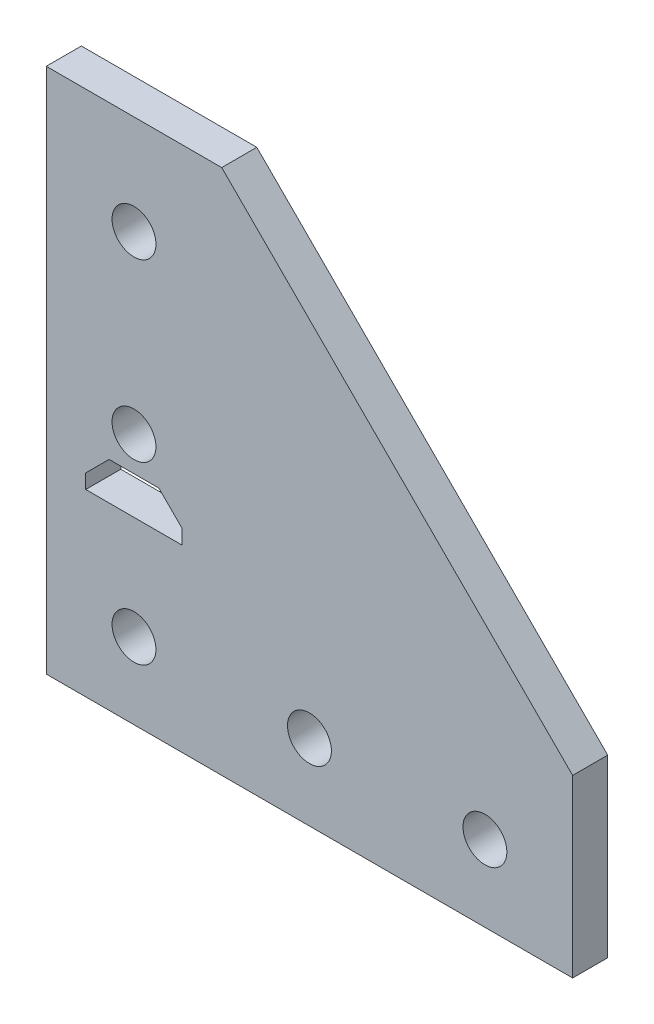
ISO-10303-21;
HEADER;
FILE_DESCRIPTION(('STEP AP214'),'2;1');
FILE_NAME('part.step','',(''),(''),'','','');
FILE_SCHEMA(('AUTOMOTIVE_DESIGN { 1 0 10303 214 1 1 1 1 }'));
ENDSEC;
DATA;
#1=APPLICATION_CONTEXT('core data for automotive mechanical design processes');
#2=APPLICATION_PROTOCOL_DEFINITION('international standard','automotive_design',2000,#1);
#3=PRODUCT_CONTEXT('',#1,'mechanical');
#4=PRODUCT('Part','Part','',(#3));
#5=PRODUCT_RELATED_PRODUCT_CATEGORY('part','',(#4));
#6=PRODUCT_DEFINITION_FORMATION('','',#4);
#7=PRODUCT_DEFINITION_CONTEXT('part definition',#1,'design');
#8=PRODUCT_DEFINITION('design','',#6,#7);
#9=PRODUCT_DEFINITION_SHAPE('','',#8);
#10=(LENGTH_UNIT() NAMED_UNIT(*) SI_UNIT(.MILLI.,.METRE.));
#11=(NAMED_UNIT(*) PLANE_ANGLE_UNIT() SI_UNIT($,.RADIAN.));
#12=(NAMED_UNIT(*) SI_UNIT($,.STERADIAN.) SOLID_ANGLE_UNIT());
#13=UNCERTAINTY_MEASURE_WITH_UNIT(LENGTH_MEASURE(1.E-05),#10,'distance_accuracy_value','');
#14=(GEOMETRIC_REPRESENTATION_CONTEXT(3) GLOBAL_UNCERTAINTY_ASSIGNED_CONTEXT((#13)) GLOBAL_UNIT_ASSIGNED_CONTEXT((#10,
#11,#12)) REPRESENTATION_CONTEXT('',''));
#15=CARTESIAN_POINT('',(0.,0.,0.));
#16=DIRECTION('',(0.,0.,1.));
#17=DIRECTION('',(1.,0.,0.));
#18=AXIS2_PLACEMENT_3D('',#15,#16,#17);
#19=CARTESIAN_POINT('',(10.,28.6725347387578,84.9470423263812));
#20=DIRECTION('',(0.,0.,1.));
#21=DIRECTION('',(1.,0.,0.));
#22=AXIS2_PLACEMENT_3D('',#19,#20,#21);
#23=CYLINDRICAL_SURFACE('',#22,2.5);
#24=CARTESIAN_POINT('',(10.,28.6725347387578,4.));
#25=DIRECTION('',(0.,0.,-1.));
#26=DIRECTION('',(1.,0.,0.));
#27=AXIS2_PLACEMENT_3D('',#24,#25,#26);
#28=CIRCLE('',#27,2.5);
#29=CARTESIAN_POINT('',(7.5,28.6725347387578,4.));
#30=VERTEX_POINT('',#29);
#31=EDGE_CURVE('E205',#30,#30,#28,.T.);
#32=ORIENTED_EDGE('',*,*,#31,.F.);
#33=EDGE_LOOP('',(#32));
#34=FACE_BOUND('',#33,.T.);
#35=CARTESIAN_POINT('',(10.,28.6725347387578,0.));
#36=DIRECTION('',(0.,0.,1.));
#37=DIRECTION('',(1.,0.,0.));
#38=AXIS2_PLACEMENT_3D('',#35,#36,#37);
#39=CIRCLE('',#38,2.5);
#40=CARTESIAN_POINT('',(12.5,28.6725347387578,0.));
#41=VERTEX_POINT('',#40);
#42=EDGE_CURVE('E210',#41,#41,#39,.T.);
#43=ORIENTED_EDGE('',*,*,#42,.F.);
#44=EDGE_LOOP('',(#43));
#45=FACE_BOUND('',#44,.T.);
#46=ADVANCED_FACE('F37',(#34,#45),#23,.F.);
#47=CARTESIAN_POINT('',(30.,8.67253473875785,84.9470423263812));
#48=DIRECTION('',(0.,0.,1.));
#49=DIRECTION('',(1.,0.,0.));
#50=AXIS2_PLACEMENT_3D('',#47,#48,#49);
#51=CYLINDRICAL_SURFACE('',#50,2.5);
#52=CARTESIAN_POINT('',(30.,8.67253473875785,4.));
#53=DIRECTION('',(0.,0.,-1.));
#54=DIRECTION('',(1.,0.,0.));
#55=AXIS2_PLACEMENT_3D('',#52,#53,#54);
#56=CIRCLE('',#55,2.5);
#57=CARTESIAN_POINT('',(27.5,8.67253473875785,4.));
#58=VERTEX_POINT('',#57);
#59=EDGE_CURVE('E209',#58,#58,#56,.T.);
#60=ORIENTED_EDGE('',*,*,#59,.F.);
#61=EDGE_LOOP('',(#60));
#62=FACE_BOUND('',#61,.T.);
#63=CARTESIAN_POINT('',(30.,8.67253473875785,0.));
#64=DIRECTION('',(0.,0.,1.));
#65=DIRECTION('',(1.,0.,0.));
#66=AXIS2_PLACEMENT_3D('',#63,#64,#65);
#67=CIRCLE('',#66,2.5);
#68=CARTESIAN_POINT('',(32.5,8.67253473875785,0.));
#69=VERTEX_POINT('',#68);
#70=EDGE_CURVE('E214',#69,#69,#67,.T.);
#71=ORIENTED_EDGE('',*,*,#70,.F.);
#72=EDGE_LOOP('',(#71));
#73=FACE_BOUND('',#72,.T.);
#74=ADVANCED_FACE('F296',(#62,#73),#51,.F.);
#75=CARTESIAN_POINT('',(10.,8.67253473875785,84.9470423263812));
#76=DIRECTION('',(0.,0.,1.));
#77=DIRECTION('',(1.,0.,0.));
#78=AXIS2_PLACEMENT_3D('',#75,#76,#77);
#79=CYLINDRICAL_SURFACE('',#78,2.5);
#80=CARTESIAN_POINT('',(10.,8.67253473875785,4.));
#81=DIRECTION('',(0.,0.,-1.));
#82=DIRECTION('',(1.,0.,0.));
#83=AXIS2_PLACEMENT_3D('',#80,#81,#82);
#84=CIRCLE('',#83,2.5);
#85=CARTESIAN_POINT('',(7.5,8.67253473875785,4.));
#86=VERTEX_POINT('',#85);
#87=EDGE_CURVE('E217',#86,#86,#84,.T.);
#88=ORIENTED_EDGE('',*,*,#87,.F.);
#89=EDGE_LOOP('',(#88));
#90=FACE_BOUND('',#89,.T.);
#91=CARTESIAN_POINT('',(10.,8.67253473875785,0.));
#92=DIRECTION('',(0.,0.,1.));
#93=DIRECTION('',(1.,0.,0.));
#94=AXIS2_PLACEMENT_3D('',#91,#92,#93);
#95=CIRCLE('',#94,2.5);
#96=CARTESIAN_POINT('',(12.5,8.67253473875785,0.));
#97=VERTEX_POINT('',#96);
#98=EDGE_CURVE('E220',#97,#97,#95,.T.);
#99=ORIENTED_EDGE('',*,*,#98,.F.);
#100=EDGE_LOOP('',(#99));
#101=FACE_BOUND('',#100,.T.);
#102=ADVANCED_FACE('F302',(#90,#101),#79,.F.);
#103=CARTESIAN_POINT('',(50.,8.67253473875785,84.9470423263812));
#104=DIRECTION('',(0.,0.,1.));
#105=DIRECTION('',(1.,0.,0.));
#106=AXIS2_PLACEMENT_3D('',#103,#104,#105);
#107=CYLINDRICAL_SURFACE('',#106,2.5);
#108=CARTESIAN_POINT('',(50.,8.67253473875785,4.));
#109=DIRECTION('',(0.,0.,-1.));
#110=DIRECTION('',(1.,0.,0.));
#111=AXIS2_PLACEMENT_3D('',#108,#109,#110);
#112=CIRCLE('',#111,2.5);
#113=CARTESIAN_POINT('',(47.5,8.67253473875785,4.));
#114=VERTEX_POINT('',#113);
#115=EDGE_CURVE('E223',#114,#114,#112,.T.);
#116=ORIENTED_EDGE('',*,*,#115,.F.);
#117=EDGE_LOOP('',(#116));
#118=FACE_BOUND('',#117,.T.);
#119=CARTESIAN_POINT('',(50.,8.67253473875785,0.));
#120=DIRECTION('',(0.,0.,1.));
#121=DIRECTION('',(1.,0.,0.));
#122=AXIS2_PLACEMENT_3D('',#119,#120,#121);
#123=CIRCLE('',#122,2.5);
#124=CARTESIAN_POINT('',(52.5,8.67253473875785,0.));
#125=VERTEX_POINT('',#124);
#126=EDGE_CURVE('E226',#125,#125,#123,.T.);
#127=ORIENTED_EDGE('',*,*,#126,.F.);
#128=EDGE_LOOP('',(#127));
#129=FACE_BOUND('',#128,.T.);
#130=ADVANCED_FACE('F311',(#118,#129),#107,.F.);
#131=CARTESIAN_POINT('',(10.,48.6725347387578,84.9470423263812));
#132=DIRECTION('',(0.,0.,1.));
#133=DIRECTION('',(1.,0.,0.));
#134=AXIS2_PLACEMENT_3D('',#131,#132,#133);
#135=CYLINDRICAL_SURFACE('',#134,2.5);
#136=CARTESIAN_POINT('',(10.,48.6725347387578,4.));
#137=DIRECTION('',(0.,0.,-1.));
#138=DIRECTION('',(1.,0.,0.));
#139=AXIS2_PLACEMENT_3D('',#136,#137,#138);
#140=CIRCLE('',#139,2.5);
#141=CARTESIAN_POINT('',(7.5,48.6725347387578,4.));
#142=VERTEX_POINT('',#141);
#143=EDGE_CURVE('E229',#142,#142,#140,.T.);
#144=ORIENTED_EDGE('',*,*,#143,.F.);
#145=EDGE_LOOP('',(#144));
#146=FACE_BOUND('',#145,.T.);
#147=CARTESIAN_POINT('',(10.,48.6725347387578,0.));
#148=DIRECTION('',(0.,0.,1.));
#149=DIRECTION('',(1.,0.,0.));
#150=AXIS2_PLACEMENT_3D('',#147,#148,#149);
#151=CIRCLE('',#150,2.5);
#152=CARTESIAN_POINT('',(12.5,48.6725347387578,0.));
#153=VERTEX_POINT('',#152);
#154=EDGE_CURVE('E232',#153,#153,#151,.T.);
#155=ORIENTED_EDGE('',*,*,#154,.F.);
#156=EDGE_LOOP('',(#155));
#157=FACE_BOUND('',#156,.T.);
#158=ADVANCED_FACE('F315',(#146,#157),#135,.F.);
#159=CARTESIAN_POINT('',(20.,60.,0.));
#160=DIRECTION('',(0.,1.,0.));
#161=DIRECTION('',(0.707106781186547,0.,0.707106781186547));
#162=AXIS2_PLACEMENT_3D('',#159,#160,#161);
#163=PLANE('',#162);
#164=DIRECTION('',(1.,0.,0.));
#165=VECTOR('',#164,1.);
#166=CARTESIAN_POINT('',(0.,60.,0.));
#167=LINE('',#166,#165);
#168=CARTESIAN_POINT('',(0.,60.,0.));
#169=VERTEX_POINT('',#168);
#170=CARTESIAN_POINT('',(20.,60.,0.));
#171=VERTEX_POINT('',#170);
#172=EDGE_CURVE('E238',#169,#171,#167,.T.);
#173=ORIENTED_EDGE('',*,*,#172,.F.);
#174=DIRECTION('',(0.,0.,1.));
#175=VECTOR('',#174,1.);
#176=CARTESIAN_POINT('',(0.,60.,0.));
#177=LINE('',#176,#175);
#178=CARTESIAN_POINT('',(0.,60.,4.));
#179=VERTEX_POINT('',#178);
#180=EDGE_CURVE('E12',#169,#179,#177,.T.);
#181=ORIENTED_EDGE('',*,*,#180,.T.);
#182=DIRECTION('',(-1.,0.,0.));
#183=VECTOR('',#182,1.);
#184=CARTESIAN_POINT('',(0.,60.,4.));
#185=LINE('',#184,#183);
#186=CARTESIAN_POINT('',(20.,60.,4.));
#187=VERTEX_POINT('',#186);
#188=EDGE_CURVE('E213',#187,#179,#185,.T.);
#189=ORIENTED_EDGE('',*,*,#188,.F.);
#190=DIRECTION('',(0.,0.,1.));
#191=VECTOR('',#190,1.);
#192=CARTESIAN_POINT('',(20.,60.,0.));
#193=LINE('',#192,#191);
#194=EDGE_CURVE('E46',#171,#187,#193,.T.);
#195=ORIENTED_EDGE('',*,*,#194,.F.);
#196=EDGE_LOOP('',(#173,#181,#189,#195));
#197=FACE_BOUND('',#196,.T.);
#198=ADVANCED_FACE('F276',(#197),#163,.T.);
#199=CARTESIAN_POINT('',(60.,20.,0.));
#200=DIRECTION('',(0.707106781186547,0.707106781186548,0.));
#201=DIRECTION('',(-0.577350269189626,0.577350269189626,0.577350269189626));
#202=AXIS2_PLACEMENT_3D('',#199,#200,#201);
#203=PLANE('',#202);
#204=DIRECTION('',(0.707106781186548,-0.707106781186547,0.));
#205=VECTOR('',#204,1.);
#206=CARTESIAN_POINT('',(20.,60.,0.));
#207=LINE('',#206,#205);
#208=CARTESIAN_POINT('',(60.,20.,0.));
#209=VERTEX_POINT('',#208);
#210=EDGE_CURVE('E239',#171,#209,#207,.T.);
#211=ORIENTED_EDGE('',*,*,#210,.F.);
#212=ORIENTED_EDGE('',*,*,#194,.T.);
#213=DIRECTION('',(-0.707106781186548,0.707106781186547,0.));
#214=VECTOR('',#213,1.);
#215=CARTESIAN_POINT('',(20.,60.,4.));
#216=LINE('',#215,#214);
#217=CARTESIAN_POINT('',(60.,20.,4.));
#218=VERTEX_POINT('',#217);
#219=EDGE_CURVE('E242',#218,#187,#216,.T.);
#220=ORIENTED_EDGE('',*,*,#219,.F.);
#221=DIRECTION('',(0.,0.,1.));
#222=VECTOR('',#221,1.);
#223=CARTESIAN_POINT('',(60.,20.,0.));
#224=LINE('',#223,#222);
#225=EDGE_CURVE('E245',#209,#218,#224,.T.);
#226=ORIENTED_EDGE('',*,*,#225,.F.);
#227=EDGE_LOOP('',(#211,#212,#220,#226));
#228=FACE_BOUND('',#227,.T.);
#229=ADVANCED_FACE('F280',(#228),#203,.T.);
#230=CARTESIAN_POINT('',(60.,0.,0.));
#231=DIRECTION('',(1.,0.,0.));
#232=DIRECTION('',(0.,0.707106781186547,0.707106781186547));
#233=AXIS2_PLACEMENT_3D('',#230,#231,#232);
#234=PLANE('',#233);
#235=DIRECTION('',(0.,-1.,0.));
#236=VECTOR('',#235,1.);
#237=CARTESIAN_POINT('',(60.,20.,0.));
#238=LINE('',#237,#236);
#239=CARTESIAN_POINT('',(60.,0.,0.));
#240=VERTEX_POINT('',#239);
#241=EDGE_CURVE('E247',#209,#240,#238,.T.);
#242=ORIENTED_EDGE('',*,*,#241,.F.);
#243=ORIENTED_EDGE('',*,*,#225,.T.);
#244=DIRECTION('',(0.,1.,0.));
#245=VECTOR('',#244,1.);
#246=CARTESIAN_POINT('',(60.,20.,4.));
#247=LINE('',#246,#245);
#248=CARTESIAN_POINT('',(60.,0.,4.));
#249=VERTEX_POINT('',#248);
#250=EDGE_CURVE('E250',#249,#218,#247,.T.);
#251=ORIENTED_EDGE('',*,*,#250,.F.);
#252=DIRECTION('',(0.,0.,1.));
#253=VECTOR('',#252,1.);
#254=CARTESIAN_POINT('',(60.,0.,0.));
#255=LINE('',#254,#253);
#256=EDGE_CURVE('E253',#240,#249,#255,.T.);
#257=ORIENTED_EDGE('',*,*,#256,.F.);
#258=EDGE_LOOP('',(#242,#243,#251,#257));
#259=FACE_BOUND('',#258,.T.);
#260=ADVANCED_FACE('F284',(#259),#234,.T.);
#261=CARTESIAN_POINT('',(0.,0.,0.));
#262=DIRECTION('',(0.,-1.,0.));
#263=DIRECTION('',(0.707106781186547,0.,0.707106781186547));
#264=AXIS2_PLACEMENT_3D('',#261,#262,#263);
#265=PLANE('',#264);
#266=DIRECTION('',(-1.,0.,0.));
#267=VECTOR('',#266,1.);
#268=CARTESIAN_POINT('',(60.,0.,0.));
#269=LINE('',#268,#267);
#270=CARTESIAN_POINT('',(0.,0.,0.));
#271=VERTEX_POINT('',#270);
#272=EDGE_CURVE('E197',#240,#271,#269,.T.);
#273=ORIENTED_EDGE('',*,*,#272,.F.);
#274=ORIENTED_EDGE('',*,*,#256,.T.);
#275=DIRECTION('',(1.,0.,0.));
#276=VECTOR('',#275,1.);
#277=CARTESIAN_POINT('',(60.,0.,4.));
#278=LINE('',#277,#276);
#279=CARTESIAN_POINT('',(0.,0.,4.));
#280=VERTEX_POINT('',#279);
#281=EDGE_CURVE('E257',#280,#249,#278,.T.);
#282=ORIENTED_EDGE('',*,*,#281,.F.);
#283=DIRECTION('',(0.,0.,1.));
#284=VECTOR('',#283,1.);
#285=CARTESIAN_POINT('',(0.,0.,0.));
#286=LINE('',#285,#284);
#287=EDGE_CURVE('E208',#271,#280,#286,.T.);
#288=ORIENTED_EDGE('',*,*,#287,.F.);
#289=EDGE_LOOP('',(#273,#274,#282,#288));
#290=FACE_BOUND('',#289,.T.);
#291=ADVANCED_FACE('F286',(#290),#265,.T.);
#292=CARTESIAN_POINT('',(0.,60.,0.));
#293=DIRECTION('',(-1.,0.,0.));
#294=DIRECTION('',(0.,0.707106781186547,0.707106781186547));
#295=AXIS2_PLACEMENT_3D('',#292,#293,#294);
#296=PLANE('',#295);
#297=DIRECTION('',(0.,1.,0.));
#298=VECTOR('',#297,1.);
#299=CARTESIAN_POINT('',(0.,0.,0.));
#300=LINE('',#299,#298);
#301=EDGE_CURVE('E237',#271,#169,#300,.T.);
#302=ORIENTED_EDGE('',*,*,#301,.F.);
#303=ORIENTED_EDGE('',*,*,#287,.T.);
#304=DIRECTION('',(0.,-1.,0.));
#305=VECTOR('',#304,1.);
#306=CARTESIAN_POINT('',(0.,0.,4.));
#307=LINE('',#306,#305);
#308=EDGE_CURVE('E41',#179,#280,#307,.T.);
#309=ORIENTED_EDGE('',*,*,#308,.F.);
#310=ORIENTED_EDGE('',*,*,#180,.F.);
#311=EDGE_LOOP('',(#302,#303,#309,#310));
#312=FACE_BOUND('',#311,.T.);
#313=ADVANCED_FACE('F272',(#312),#296,.T.);
#314=CARTESIAN_POINT('',(25.2240774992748,25.2240774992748,4.));
#315=DIRECTION('',(0.,0.,1.));
#316=DIRECTION('',(0.707106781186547,0.707106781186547,0.));
#317=AXIS2_PLACEMENT_3D('',#314,#315,#316);
#318=PLANE('',#317);
#319=DIRECTION('',(0.,-1.,0.));
#320=VECTOR('',#319,1.);
#321=CARTESIAN_POINT('',(15.4993398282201,20.4725347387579,4.));
#322=LINE('',#321,#320);
#323=CARTESIAN_POINT('',(15.4993398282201,22.1125347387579,4.));
#324=VERTEX_POINT('',#323);
#325=CARTESIAN_POINT('',(15.4993398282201,20.4725347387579,4.));
#326=VERTEX_POINT('',#325);
#327=EDGE_CURVE('E154',#324,#326,#322,.T.);
#328=ORIENTED_EDGE('',*,*,#327,.T.);
#329=DIRECTION('',(-1.,0.,0.));
#330=VECTOR('',#329,1.);
#331=CARTESIAN_POINT('',(12.8399999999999,20.4725347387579,4.));
#332=LINE('',#331,#330);
#333=CARTESIAN_POINT('',(4.50066017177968,20.4725347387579,4.));
#334=VERTEX_POINT('',#333);
#335=EDGE_CURVE('E163',#326,#334,#332,.T.);
#336=ORIENTED_EDGE('',*,*,#335,.T.);
#337=DIRECTION('',(0.,1.,0.));
#338=VECTOR('',#337,1.);
#339=CARTESIAN_POINT('',(4.50066017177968,22.1125347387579,4.));
#340=LINE('',#339,#338);
#341=CARTESIAN_POINT('',(4.50066017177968,22.1125347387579,4.));
#342=VERTEX_POINT('',#341);
#343=EDGE_CURVE('E54',#334,#342,#340,.T.);
#344=ORIENTED_EDGE('',*,*,#343,.T.);
#345=DIRECTION('',(0.70710678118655,0.707106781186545,0.));
#346=VECTOR('',#345,1.);
#347=CARTESIAN_POINT('',(7.15999999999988,24.7718745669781,4.));
#348=LINE('',#347,#346);
#349=CARTESIAN_POINT('',(7.15999999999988,24.7718745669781,4.));
#350=VERTEX_POINT('',#349);
#351=EDGE_CURVE('E178',#342,#350,#348,.T.);
#352=ORIENTED_EDGE('',*,*,#351,.T.);
#353=DIRECTION('',(1.,0.,0.));
#354=VECTOR('',#353,1.);
#355=CARTESIAN_POINT('',(12.8399999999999,24.7718745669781,4.));
#356=LINE('',#355,#354);
#357=CARTESIAN_POINT('',(12.8399999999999,24.7718745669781,4.));
#358=VERTEX_POINT('',#357);
#359=EDGE_CURVE('E181',#350,#358,#356,.T.);
#360=ORIENTED_EDGE('',*,*,#359,.T.);
#361=DIRECTION('',(0.707106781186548,-0.707106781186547,0.));
#362=VECTOR('',#361,1.);
#363=CARTESIAN_POINT('',(15.4993398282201,22.1125347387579,4.));
#364=LINE('',#363,#362);
#365=EDGE_CURVE('E160',#358,#324,#364,.T.);
#366=ORIENTED_EDGE('',*,*,#365,.T.);
#367=EDGE_LOOP('',(#328,#336,#344,#352,#360,#366));
#368=FACE_BOUND('',#367,.T.);
#369=ORIENTED_EDGE('',*,*,#31,.T.);
#370=EDGE_LOOP('',(#369));
#371=FACE_BOUND('',#370,.T.);
#372=ORIENTED_EDGE('',*,*,#59,.T.);
#373=EDGE_LOOP('',(#372));
#374=FACE_BOUND('',#373,.T.);
#375=ORIENTED_EDGE('',*,*,#87,.T.);
#376=EDGE_LOOP('',(#375));
#377=FACE_BOUND('',#376,.T.);
#378=ORIENTED_EDGE('',*,*,#115,.T.);
#379=EDGE_LOOP('',(#378));
#380=FACE_BOUND('',#379,.T.);
#381=ORIENTED_EDGE('',*,*,#143,.T.);
#382=EDGE_LOOP('',(#381));
#383=FACE_BOUND('',#382,.T.);
#384=ORIENTED_EDGE('',*,*,#308,.T.);
#385=ORIENTED_EDGE('',*,*,#281,.T.);
#386=ORIENTED_EDGE('',*,*,#250,.T.);
#387=ORIENTED_EDGE('',*,*,#219,.T.);
#388=ORIENTED_EDGE('',*,*,#188,.T.);
#389=EDGE_LOOP('',(#384,#385,#386,#387,#388));
#390=FACE_BOUND('',#389,.T.);
#391=ADVANCED_FACE('F167',(#368,#371,#374,#377,#380,#383,#390),#318,.T.);
#392=CARTESIAN_POINT('',(25.2240774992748,25.2240774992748,0.));
#393=DIRECTION('',(0.,0.,1.));
#394=DIRECTION('',(0.707106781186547,0.707106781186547,0.));
#395=AXIS2_PLACEMENT_3D('',#392,#393,#394);
#396=PLANE('',#395);
#397=DIRECTION('',(-1.,0.,0.));
#398=VECTOR('',#397,1.);
#399=CARTESIAN_POINT('',(4.50066017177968,20.4725347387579,0.));
#400=LINE('',#399,#398);
#401=CARTESIAN_POINT('',(15.4993398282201,20.4725347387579,0.));
#402=VERTEX_POINT('',#401);
#403=CARTESIAN_POINT('',(4.50066017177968,20.4725347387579,0.));
#404=VERTEX_POINT('',#403);
#405=EDGE_CURVE('E185',#402,#404,#400,.T.);
#406=ORIENTED_EDGE('',*,*,#405,.F.);
#407=DIRECTION('',(0.,-1.,0.));
#408=VECTOR('',#407,1.);
#409=CARTESIAN_POINT('',(15.4993398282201,20.4725347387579,0.));
#410=LINE('',#409,#408);
#411=CARTESIAN_POINT('',(15.4993398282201,22.1125347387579,0.));
#412=VERTEX_POINT('',#411);
#413=EDGE_CURVE('E62',#412,#402,#410,.T.);
#414=ORIENTED_EDGE('',*,*,#413,.F.);
#415=DIRECTION('',(0.707106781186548,-0.707106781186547,0.));
#416=VECTOR('',#415,1.);
#417=CARTESIAN_POINT('',(15.4993398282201,22.1125347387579,0.));
#418=LINE('',#417,#416);
#419=CARTESIAN_POINT('',(12.8399999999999,24.7718745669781,0.));
#420=VERTEX_POINT('',#419);
#421=EDGE_CURVE('E171',#420,#412,#418,.T.);
#422=ORIENTED_EDGE('',*,*,#421,.F.);
#423=DIRECTION('',(1.,0.,0.));
#424=VECTOR('',#423,1.);
#425=CARTESIAN_POINT('',(12.8399999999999,24.7718745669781,0.));
#426=LINE('',#425,#424);
#427=CARTESIAN_POINT('',(7.15999999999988,24.7718745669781,0.));
#428=VERTEX_POINT('',#427);
#429=EDGE_CURVE('E174',#428,#420,#426,.T.);
#430=ORIENTED_EDGE('',*,*,#429,.F.);
#431=DIRECTION('',(0.70710678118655,0.707106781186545,0.));
#432=VECTOR('',#431,1.);
#433=CARTESIAN_POINT('',(7.15999999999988,24.7718745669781,0.));
#434=LINE('',#433,#432);
#435=CARTESIAN_POINT('',(4.50066017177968,22.1125347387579,0.));
#436=VERTEX_POINT('',#435);
#437=EDGE_CURVE('E190',#436,#428,#434,.T.);
#438=ORIENTED_EDGE('',*,*,#437,.F.);
#439=DIRECTION('',(0.,1.,0.));
#440=VECTOR('',#439,1.);
#441=CARTESIAN_POINT('',(4.50066017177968,22.1125347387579,0.));
#442=LINE('',#441,#440);
#443=EDGE_CURVE('E187',#404,#436,#442,.T.);
#444=ORIENTED_EDGE('',*,*,#443,.F.);
#445=EDGE_LOOP('',(#406,#414,#422,#430,#438,#444));
#446=FACE_BOUND('',#445,.T.);
#447=ORIENTED_EDGE('',*,*,#42,.T.);
#448=EDGE_LOOP('',(#447));
#449=FACE_BOUND('',#448,.T.);
#450=ORIENTED_EDGE('',*,*,#70,.T.);
#451=EDGE_LOOP('',(#450));
#452=FACE_BOUND('',#451,.T.);
#453=ORIENTED_EDGE('',*,*,#98,.T.);
#454=EDGE_LOOP('',(#453));
#455=FACE_BOUND('',#454,.T.);
#456=ORIENTED_EDGE('',*,*,#126,.T.);
#457=EDGE_LOOP('',(#456));
#458=FACE_BOUND('',#457,.T.);
#459=ORIENTED_EDGE('',*,*,#154,.T.);
#460=EDGE_LOOP('',(#459));
#461=FACE_BOUND('',#460,.T.);
#462=ORIENTED_EDGE('',*,*,#301,.T.);
#463=ORIENTED_EDGE('',*,*,#172,.T.);
#464=ORIENTED_EDGE('',*,*,#210,.T.);
#465=ORIENTED_EDGE('',*,*,#241,.T.);
#466=ORIENTED_EDGE('',*,*,#272,.T.);
#467=EDGE_LOOP('',(#462,#463,#464,#465,#466));
#468=FACE_BOUND('',#467,.T.);
#469=ADVANCED_FACE('F39',(#446,#449,#452,#455,#458,#461,#468),#396,.F.);
#470=CARTESIAN_POINT('',(15.4993398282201,20.4725347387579,4.));
#471=DIRECTION('',(1.,0.,0.));
#472=DIRECTION('',(0.,0.,-1.));
#473=AXIS2_PLACEMENT_3D('',#470,#471,#472);
#474=PLANE('',#473);
#475=ORIENTED_EDGE('',*,*,#413,.T.);
#476=DIRECTION('',(0.,0.,-1.));
#477=VECTOR('',#476,1.);
#478=CARTESIAN_POINT('',(15.4993398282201,20.4725347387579,4.));
#479=LINE('',#478,#477);
#480=EDGE_CURVE('E150',#326,#402,#479,.T.);
#481=ORIENTED_EDGE('',*,*,#480,.F.);
#482=ORIENTED_EDGE('',*,*,#327,.F.);
#483=DIRECTION('',(0.,0.,-1.));
#484=VECTOR('',#483,1.);
#485=CARTESIAN_POINT('',(15.4993398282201,22.1125347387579,4.));
#486=LINE('',#485,#484);
#487=EDGE_CURVE('E195',#324,#412,#486,.T.);
#488=ORIENTED_EDGE('',*,*,#487,.T.);
#489=EDGE_LOOP('',(#475,#481,#482,#488));
#490=FACE_BOUND('',#489,.T.);
#491=ADVANCED_FACE('F152',(#490),#474,.F.);
#492=CARTESIAN_POINT('',(15.4993398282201,22.1125347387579,4.));
#493=DIRECTION('',(0.707106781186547,0.707106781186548,0.));
#494=DIRECTION('',(-0.707106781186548,0.707106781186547,0.));
#495=AXIS2_PLACEMENT_3D('',#492,#493,#494);
#496=PLANE('',#495);
#497=ORIENTED_EDGE('',*,*,#421,.T.);
#498=ORIENTED_EDGE('',*,*,#487,.F.);
#499=ORIENTED_EDGE('',*,*,#365,.F.);
#500=DIRECTION('',(0.,0.,-1.));
#501=VECTOR('',#500,1.);
#502=CARTESIAN_POINT('',(12.8399999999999,24.7718745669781,4.));
#503=LINE('',#502,#501);
#504=EDGE_CURVE('E198',#358,#420,#503,.T.);
#505=ORIENTED_EDGE('',*,*,#504,.T.);
#506=EDGE_LOOP('',(#497,#498,#499,#505));
#507=FACE_BOUND('',#506,.T.);
#508=ADVANCED_FACE('F368',(#507),#496,.F.);
#509=CARTESIAN_POINT('',(12.8399999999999,24.7718745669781,4.));
#510=DIRECTION('',(0.,1.,0.));
#511=DIRECTION('',(0.,0.,1.));
#512=AXIS2_PLACEMENT_3D('',#509,#510,#511);
#513=PLANE('',#512);
#514=ORIENTED_EDGE('',*,*,#429,.T.);
#515=ORIENTED_EDGE('',*,*,#504,.F.);
#516=ORIENTED_EDGE('',*,*,#359,.F.);
#517=DIRECTION('',(0.,0.,-1.));
#518=VECTOR('',#517,1.);
#519=CARTESIAN_POINT('',(7.15999999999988,24.7718745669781,4.));
#520=LINE('',#519,#518);
#521=EDGE_CURVE('E200',#350,#428,#520,.T.);
#522=ORIENTED_EDGE('',*,*,#521,.T.);
#523=EDGE_LOOP('',(#514,#515,#516,#522));
#524=FACE_BOUND('',#523,.T.);
#525=ADVANCED_FACE('F375',(#524),#513,.F.);
#526=CARTESIAN_POINT('',(7.15999999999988,24.7718745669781,4.));
#527=DIRECTION('',(-0.707106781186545,0.70710678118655,0.));
#528=DIRECTION('',(-0.70710678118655,-0.707106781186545,0.));
#529=AXIS2_PLACEMENT_3D('',#526,#527,#528);
#530=PLANE('',#529);
#531=ORIENTED_EDGE('',*,*,#437,.T.);
#532=ORIENTED_EDGE('',*,*,#521,.F.);
#533=ORIENTED_EDGE('',*,*,#351,.F.);
#534=DIRECTION('',(0.,0.,-1.));
#535=VECTOR('',#534,1.);
#536=CARTESIAN_POINT('',(4.50066017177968,22.1125347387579,4.));
#537=LINE('',#536,#535);
#538=EDGE_CURVE('E202',#342,#436,#537,.T.);
#539=ORIENTED_EDGE('',*,*,#538,.T.);
#540=EDGE_LOOP('',(#531,#532,#533,#539));
#541=FACE_BOUND('',#540,.T.);
#542=ADVANCED_FACE('F384',(#541),#530,.F.);
#543=CARTESIAN_POINT('',(4.50066017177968,22.1125347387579,4.));
#544=DIRECTION('',(-1.,0.,0.));
#545=DIRECTION('',(0.,-1.,0.));
#546=AXIS2_PLACEMENT_3D('',#543,#544,#545);
#547=PLANE('',#546);
#548=ORIENTED_EDGE('',*,*,#443,.T.);
#549=ORIENTED_EDGE('',*,*,#538,.F.);
#550=ORIENTED_EDGE('',*,*,#343,.F.);
#551=DIRECTION('',(0.,0.,-1.));
#552=VECTOR('',#551,1.);
#553=CARTESIAN_POINT('',(4.50066017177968,20.4725347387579,4.));
#554=LINE('',#553,#552);
#555=EDGE_CURVE('E159',#334,#404,#554,.T.);
#556=ORIENTED_EDGE('',*,*,#555,.T.);
#557=EDGE_LOOP('',(#548,#549,#550,#556));
#558=FACE_BOUND('',#557,.T.);
#559=ADVANCED_FACE('F393',(#558),#547,.F.);
#560=CARTESIAN_POINT('',(4.50066017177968,20.4725347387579,4.));
#561=DIRECTION('',(0.,-1.,0.));
#562=DIRECTION('',(0.,0.,-1.));
#563=AXIS2_PLACEMENT_3D('',#560,#561,#562);
#564=PLANE('',#563);
#565=ORIENTED_EDGE('',*,*,#405,.T.);
#566=ORIENTED_EDGE('',*,*,#555,.F.);
#567=ORIENTED_EDGE('',*,*,#335,.F.);
#568=ORIENTED_EDGE('',*,*,#480,.T.);
#569=EDGE_LOOP('',(#565,#566,#567,#568));
#570=FACE_BOUND('',#569,.T.);
#571=ADVANCED_FACE('F164',(#570),#564,.F.);
#572=CLOSED_SHELL('',(#46,#74,#102,#130,#158,#198,#229,#260,#291,#313,#391,#469,#491,#508,#525,
#542,#559,#571));
#573=MANIFOLD_SOLID_BREP('B2',#572);
#574=ADVANCED_BREP_SHAPE_REPRESENTATION('',(#18,#573),#14);
#575=SHAPE_DEFINITION_REPRESENTATION(#9,#574);
ENDSEC;
END-ISO-10303-21;
